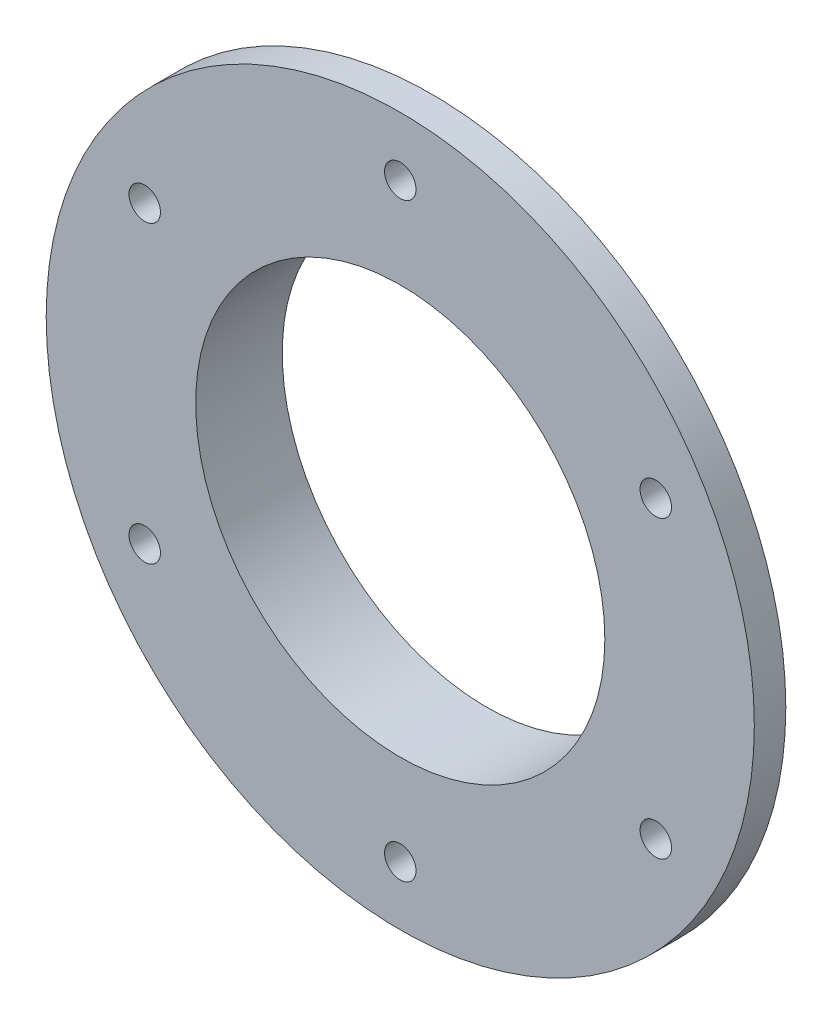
ISO-10303-21;
HEADER;
FILE_DESCRIPTION(('STEP AP214'),'2;1');
FILE_NAME('part.step','',(''),(''),'','','');
FILE_SCHEMA(('AUTOMOTIVE_DESIGN { 1 0 10303 214 1 1 1 1 }'));
ENDSEC;
DATA;
#1=APPLICATION_CONTEXT('core data for automotive mechanical design processes');
#2=APPLICATION_PROTOCOL_DEFINITION('international standard','automotive_design',2000,#1);
#3=PRODUCT_CONTEXT('',#1,'mechanical');
#4=PRODUCT('Part','Part','',(#3));
#5=PRODUCT_RELATED_PRODUCT_CATEGORY('part','',(#4));
#6=PRODUCT_DEFINITION_FORMATION('','',#4);
#7=PRODUCT_DEFINITION_CONTEXT('part definition',#1,'design');
#8=PRODUCT_DEFINITION('design','',#6,#7);
#9=PRODUCT_DEFINITION_SHAPE('','',#8);
#10=(LENGTH_UNIT() NAMED_UNIT(*) SI_UNIT(.MILLI.,.METRE.));
#11=(NAMED_UNIT(*) PLANE_ANGLE_UNIT() SI_UNIT($,.RADIAN.));
#12=(NAMED_UNIT(*) SI_UNIT($,.STERADIAN.) SOLID_ANGLE_UNIT());
#13=UNCERTAINTY_MEASURE_WITH_UNIT(LENGTH_MEASURE(1.E-05),#10,'distance_accuracy_value','');
#14=(GEOMETRIC_REPRESENTATION_CONTEXT(3) GLOBAL_UNCERTAINTY_ASSIGNED_CONTEXT((#13)) GLOBAL_UNIT_ASSIGNED_CONTEXT((#10,
#11,#12)) REPRESENTATION_CONTEXT('',''));
#15=CARTESIAN_POINT('',(0.,0.,0.));
#16=DIRECTION('',(0.,0.,1.));
#17=DIRECTION('',(1.,0.,0.));
#18=AXIS2_PLACEMENT_3D('',#15,#16,#17);
#19=CARTESIAN_POINT('',(0.,0.,0.));
#20=DIRECTION('',(0.,0.,1.));
#21=DIRECTION('',(1.,0.,0.));
#22=AXIS2_PLACEMENT_3D('',#19,#20,#21);
#23=CYLINDRICAL_SURFACE('',#22,52.);
#24=CARTESIAN_POINT('',(0.,0.,-22.));
#25=DIRECTION('',(0.,0.,1.));
#26=DIRECTION('',(1.,0.,0.));
#27=AXIS2_PLACEMENT_3D('',#24,#25,#26);
#28=CIRCLE('',#27,52.);
#29=CARTESIAN_POINT('',(52.,0.,-22.));
#30=VERTEX_POINT('',#29);
#31=EDGE_CURVE('E50',#30,#30,#28,.T.);
#32=ORIENTED_EDGE('',*,*,#31,.F.);
#33=EDGE_LOOP('',(#32));
#34=FACE_BOUND('',#33,.T.);
#35=CARTESIAN_POINT('',(0.,0.,0.));
#36=DIRECTION('',(0.,0.,1.));
#37=DIRECTION('',(1.,0.,0.));
#38=AXIS2_PLACEMENT_3D('',#35,#36,#37);
#39=CIRCLE('',#38,52.);
#40=CARTESIAN_POINT('',(52.,0.,0.));
#41=VERTEX_POINT('',#40);
#42=EDGE_CURVE('E10',#41,#41,#39,.T.);
#43=ORIENTED_EDGE('',*,*,#42,.T.);
#44=EDGE_LOOP('',(#43));
#45=FACE_BOUND('',#44,.T.);
#46=ADVANCED_FACE('F31',(#34,#45),#23,.F.);
#47=CARTESIAN_POINT('',(0.,52.,0.));
#48=DIRECTION('',(0.,0.,-1.));
#49=DIRECTION('',(-1.,0.,0.));
#50=AXIS2_PLACEMENT_3D('',#47,#48,#49);
#51=PLANE('',#50);
#52=CARTESIAN_POINT('',(-64.9519052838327,-37.5000000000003,0.));
#53=DIRECTION('',(0.,0.,1.));
#54=DIRECTION('',(-0.500000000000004,0.866025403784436,0.));
#55=AXIS2_PLACEMENT_3D('',#52,#53,#54);
#56=CIRCLE('',#55,4.);
#57=CARTESIAN_POINT('',(-66.9519052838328,-34.0358983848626,0.));
#58=VERTEX_POINT('',#57);
#59=EDGE_CURVE('E60',#58,#58,#56,.T.);
#60=ORIENTED_EDGE('',*,*,#59,.F.);
#61=EDGE_LOOP('',(#60));
#62=FACE_BOUND('',#61,.T.);
#63=CARTESIAN_POINT('',(0.,-75.,0.));
#64=DIRECTION('',(0.,0.,1.));
#65=DIRECTION('',(-1.,0.,0.));
#66=AXIS2_PLACEMENT_3D('',#63,#64,#65);
#67=CIRCLE('',#66,4.);
#68=CARTESIAN_POINT('',(-4.,-75.,0.));
#69=VERTEX_POINT('',#68);
#70=EDGE_CURVE('E149',#69,#69,#67,.T.);
#71=ORIENTED_EDGE('',*,*,#70,.F.);
#72=EDGE_LOOP('',(#71));
#73=FACE_BOUND('',#72,.T.);
#74=CARTESIAN_POINT('',(64.9519052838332,-37.4999999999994,0.));
#75=DIRECTION('',(0.,0.,1.));
#76=DIRECTION('',(-0.499999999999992,-0.866025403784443,0.));
#77=AXIS2_PLACEMENT_3D('',#74,#75,#76);
#78=CIRCLE('',#77,4.);
#79=CARTESIAN_POINT('',(62.9519052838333,-40.9641016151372,0.));
#80=VERTEX_POINT('',#79);
#81=EDGE_CURVE('E152',#80,#80,#78,.T.);
#82=ORIENTED_EDGE('',*,*,#81,.F.);
#83=EDGE_LOOP('',(#82));
#84=FACE_BOUND('',#83,.T.);
#85=CARTESIAN_POINT('',(64.9519052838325,37.5000000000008,0.));
#86=DIRECTION('',(0.,0.,1.));
#87=DIRECTION('',(0.50000000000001,-0.866025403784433,0.));
#88=AXIS2_PLACEMENT_3D('',#85,#86,#87);
#89=CIRCLE('',#88,4.);
#90=CARTESIAN_POINT('',(66.9519052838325,34.035898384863,0.));
#91=VERTEX_POINT('',#90);
#92=EDGE_CURVE('E75',#91,#91,#89,.T.);
#93=ORIENTED_EDGE('',*,*,#92,.F.);
#94=EDGE_LOOP('',(#93));
#95=FACE_BOUND('',#94,.T.);
#96=CARTESIAN_POINT('',(-64.951905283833,37.4999999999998,0.));
#97=DIRECTION('',(0.,0.,1.));
#98=DIRECTION('',(0.499999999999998,0.86602540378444,0.));
#99=AXIS2_PLACEMENT_3D('',#96,#97,#98);
#100=CIRCLE('',#99,4.);
#101=CARTESIAN_POINT('',(-62.951905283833,40.9641016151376,0.));
#102=VERTEX_POINT('',#101);
#103=EDGE_CURVE('E55',#102,#102,#100,.T.);
#104=ORIENTED_EDGE('',*,*,#103,.F.);
#105=EDGE_LOOP('',(#104));
#106=FACE_BOUND('',#105,.T.);
#107=CARTESIAN_POINT('',(0.,75.,0.));
#108=DIRECTION('',(0.,0.,1.));
#109=DIRECTION('',(1.,0.,0.));
#110=AXIS2_PLACEMENT_3D('',#107,#108,#109);
#111=CIRCLE('',#110,4.);
#112=CARTESIAN_POINT('',(4.,75.,0.));
#113=VERTEX_POINT('',#112);
#114=EDGE_CURVE('E51',#113,#113,#111,.T.);
#115=ORIENTED_EDGE('',*,*,#114,.F.);
#116=EDGE_LOOP('',(#115));
#117=FACE_BOUND('',#116,.T.);
#118=ORIENTED_EDGE('',*,*,#42,.F.);
#119=EDGE_LOOP('',(#118));
#120=FACE_BOUND('',#119,.T.);
#121=CARTESIAN_POINT('',(0.,0.,0.));
#122=DIRECTION('',(0.,0.,1.));
#123=DIRECTION('',(1.,0.,0.));
#124=AXIS2_PLACEMENT_3D('',#121,#122,#123);
#125=CIRCLE('',#124,90.);
#126=CARTESIAN_POINT('',(90.,0.,0.));
#127=VERTEX_POINT('',#126);
#128=EDGE_CURVE('E38',#127,#127,#125,.T.);
#129=ORIENTED_EDGE('',*,*,#128,.T.);
#130=EDGE_LOOP('',(#129));
#131=FACE_BOUND('',#130,.T.);
#132=ADVANCED_FACE('F111',(#62,#73,#84,#95,#106,#117,#120,#131),#51,.F.);
#133=CARTESIAN_POINT('',(0.,0.,0.));
#134=DIRECTION('',(0.,0.,1.));
#135=DIRECTION('',(1.,0.,0.));
#136=AXIS2_PLACEMENT_3D('',#133,#134,#135);
#137=CYLINDRICAL_SURFACE('',#136,90.);
#138=ORIENTED_EDGE('',*,*,#128,.F.);
#139=EDGE_LOOP('',(#138));
#140=FACE_BOUND('',#139,.T.);
#141=CARTESIAN_POINT('',(0.,0.,-8.));
#142=DIRECTION('',(0.,0.,1.));
#143=DIRECTION('',(1.,0.,0.));
#144=AXIS2_PLACEMENT_3D('',#141,#142,#143);
#145=CIRCLE('',#144,90.);
#146=CARTESIAN_POINT('',(90.,0.,-8.));
#147=VERTEX_POINT('',#146);
#148=EDGE_CURVE('E43',#147,#147,#145,.T.);
#149=ORIENTED_EDGE('',*,*,#148,.T.);
#150=EDGE_LOOP('',(#149));
#151=FACE_BOUND('',#150,.T.);
#152=ADVANCED_FACE('F89',(#140,#151),#137,.T.);
#153=CARTESIAN_POINT('',(0.,90.,-8.));
#154=DIRECTION('',(0.,0.,1.));
#155=DIRECTION('',(1.,0.,0.));
#156=AXIS2_PLACEMENT_3D('',#153,#154,#155);
#157=PLANE('',#156);
#158=CARTESIAN_POINT('',(-64.9519052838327,-37.5000000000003,-8.));
#159=DIRECTION('',(0.,0.,1.));
#160=DIRECTION('',(1.,0.,0.));
#161=AXIS2_PLACEMENT_3D('',#158,#159,#160);
#162=CIRCLE('',#161,4.);
#163=CARTESIAN_POINT('',(-60.9519052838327,-37.5000000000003,-8.));
#164=VERTEX_POINT('',#163);
#165=EDGE_CURVE('E34',#164,#164,#162,.T.);
#166=ORIENTED_EDGE('',*,*,#165,.T.);
#167=EDGE_LOOP('',(#166));
#168=FACE_BOUND('',#167,.T.);
#169=CARTESIAN_POINT('',(0.,-75.,-8.));
#170=DIRECTION('',(0.,0.,1.));
#171=DIRECTION('',(1.,0.,0.));
#172=AXIS2_PLACEMENT_3D('',#169,#170,#171);
#173=CIRCLE('',#172,4.);
#174=CARTESIAN_POINT('',(4.,-75.,-8.));
#175=VERTEX_POINT('',#174);
#176=EDGE_CURVE('E62',#175,#175,#173,.T.);
#177=ORIENTED_EDGE('',*,*,#176,.T.);
#178=EDGE_LOOP('',(#177));
#179=FACE_BOUND('',#178,.T.);
#180=CARTESIAN_POINT('',(64.9519052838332,-37.4999999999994,-8.));
#181=DIRECTION('',(0.,0.,1.));
#182=DIRECTION('',(1.,0.,0.));
#183=AXIS2_PLACEMENT_3D('',#180,#181,#182);
#184=CIRCLE('',#183,4.);
#185=CARTESIAN_POINT('',(68.9519052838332,-37.4999999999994,-8.));
#186=VERTEX_POINT('',#185);
#187=EDGE_CURVE('E59',#186,#186,#184,.T.);
#188=ORIENTED_EDGE('',*,*,#187,.T.);
#189=EDGE_LOOP('',(#188));
#190=FACE_BOUND('',#189,.T.);
#191=CARTESIAN_POINT('',(64.9519052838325,37.5000000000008,-8.));
#192=DIRECTION('',(0.,0.,1.));
#193=DIRECTION('',(1.,0.,0.));
#194=AXIS2_PLACEMENT_3D('',#191,#192,#193);
#195=CIRCLE('',#194,4.);
#196=CARTESIAN_POINT('',(68.9519052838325,37.5000000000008,-8.));
#197=VERTEX_POINT('',#196);
#198=EDGE_CURVE('E56',#197,#197,#195,.T.);
#199=ORIENTED_EDGE('',*,*,#198,.T.);
#200=EDGE_LOOP('',(#199));
#201=FACE_BOUND('',#200,.T.);
#202=CARTESIAN_POINT('',(-64.951905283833,37.4999999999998,-8.));
#203=DIRECTION('',(0.,0.,1.));
#204=DIRECTION('',(1.,0.,0.));
#205=AXIS2_PLACEMENT_3D('',#202,#203,#204);
#206=CIRCLE('',#205,4.);
#207=CARTESIAN_POINT('',(-60.951905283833,37.4999999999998,-8.));
#208=VERTEX_POINT('',#207);
#209=EDGE_CURVE('E52',#208,#208,#206,.T.);
#210=ORIENTED_EDGE('',*,*,#209,.T.);
#211=EDGE_LOOP('',(#210));
#212=FACE_BOUND('',#211,.T.);
#213=CARTESIAN_POINT('',(0.,75.,-8.));
#214=DIRECTION('',(0.,0.,1.));
#215=DIRECTION('',(1.,0.,0.));
#216=AXIS2_PLACEMENT_3D('',#213,#214,#215);
#217=CIRCLE('',#216,4.);
#218=CARTESIAN_POINT('',(4.,75.,-8.));
#219=VERTEX_POINT('',#218);
#220=EDGE_CURVE('E47',#219,#219,#217,.T.);
#221=ORIENTED_EDGE('',*,*,#220,.T.);
#222=EDGE_LOOP('',(#221));
#223=FACE_BOUND('',#222,.T.);
#224=ORIENTED_EDGE('',*,*,#148,.F.);
#225=EDGE_LOOP('',(#224));
#226=FACE_BOUND('',#225,.T.);
#227=CARTESIAN_POINT('',(0.,0.,-8.));
#228=DIRECTION('',(0.,0.,1.));
#229=DIRECTION('',(1.,0.,0.));
#230=AXIS2_PLACEMENT_3D('',#227,#228,#229);
#231=CIRCLE('',#230,60.);
#232=CARTESIAN_POINT('',(60.,0.,-8.));
#233=VERTEX_POINT('',#232);
#234=EDGE_CURVE('E84',#233,#233,#231,.T.);
#235=ORIENTED_EDGE('',*,*,#234,.T.);
#236=EDGE_LOOP('',(#235));
#237=FACE_BOUND('',#236,.T.);
#238=ADVANCED_FACE('F91',(#168,#179,#190,#201,#212,#223,#226,#237),#157,.F.);
#239=CARTESIAN_POINT('',(0.,0.,0.));
#240=DIRECTION('',(0.,0.,1.));
#241=DIRECTION('',(1.,0.,0.));
#242=AXIS2_PLACEMENT_3D('',#239,#240,#241);
#243=CYLINDRICAL_SURFACE('',#242,60.);
#244=ORIENTED_EDGE('',*,*,#234,.F.);
#245=EDGE_LOOP('',(#244));
#246=FACE_BOUND('',#245,.T.);
#247=CARTESIAN_POINT('',(0.,0.,-22.));
#248=DIRECTION('',(0.,0.,1.));
#249=DIRECTION('',(1.,0.,0.));
#250=AXIS2_PLACEMENT_3D('',#247,#248,#249);
#251=CIRCLE('',#250,60.);
#252=CARTESIAN_POINT('',(60.,0.,-22.));
#253=VERTEX_POINT('',#252);
#254=EDGE_CURVE('E81',#253,#253,#251,.T.);
#255=ORIENTED_EDGE('',*,*,#254,.T.);
#256=EDGE_LOOP('',(#255));
#257=FACE_BOUND('',#256,.T.);
#258=ADVANCED_FACE('F94',(#246,#257),#243,.T.);
#259=CARTESIAN_POINT('',(0.,60.,-22.));
#260=DIRECTION('',(0.,0.,1.));
#261=DIRECTION('',(1.,0.,0.));
#262=AXIS2_PLACEMENT_3D('',#259,#260,#261);
#263=PLANE('',#262);
#264=ORIENTED_EDGE('',*,*,#254,.F.);
#265=EDGE_LOOP('',(#264));
#266=FACE_BOUND('',#265,.T.);
#267=ORIENTED_EDGE('',*,*,#31,.T.);
#268=EDGE_LOOP('',(#267));
#269=FACE_BOUND('',#268,.T.);
#270=ADVANCED_FACE('F100',(#266,#269),#263,.F.);
#271=CARTESIAN_POINT('',(0.,75.,-22.));
#272=DIRECTION('',(0.,0.,1.));
#273=DIRECTION('',(1.,0.,0.));
#274=AXIS2_PLACEMENT_3D('',#271,#272,#273);
#275=CYLINDRICAL_SURFACE('',#274,4.);
#276=ORIENTED_EDGE('',*,*,#114,.T.);
#277=EDGE_LOOP('',(#276));
#278=FACE_BOUND('',#277,.T.);
#279=ORIENTED_EDGE('',*,*,#220,.F.);
#280=EDGE_LOOP('',(#279));
#281=FACE_BOUND('',#280,.T.);
#282=ADVANCED_FACE('F106',(#278,#281),#275,.F.);
#283=CARTESIAN_POINT('',(-64.951905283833,37.4999999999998,-22.));
#284=DIRECTION('',(0.,0.,1.));
#285=DIRECTION('',(1.,0.,0.));
#286=AXIS2_PLACEMENT_3D('',#283,#284,#285);
#287=CYLINDRICAL_SURFACE('',#286,4.);
#288=ORIENTED_EDGE('',*,*,#103,.T.);
#289=EDGE_LOOP('',(#288));
#290=FACE_BOUND('',#289,.T.);
#291=ORIENTED_EDGE('',*,*,#209,.F.);
#292=EDGE_LOOP('',(#291));
#293=FACE_BOUND('',#292,.T.);
#294=ADVANCED_FACE('F126',(#290,#293),#287,.F.);
#295=CARTESIAN_POINT('',(64.9519052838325,37.5000000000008,-22.));
#296=DIRECTION('',(0.,0.,1.));
#297=DIRECTION('',(1.,0.,0.));
#298=AXIS2_PLACEMENT_3D('',#295,#296,#297);
#299=CYLINDRICAL_SURFACE('',#298,4.);
#300=ORIENTED_EDGE('',*,*,#92,.T.);
#301=EDGE_LOOP('',(#300));
#302=FACE_BOUND('',#301,.T.);
#303=ORIENTED_EDGE('',*,*,#198,.F.);
#304=EDGE_LOOP('',(#303));
#305=FACE_BOUND('',#304,.T.);
#306=ADVANCED_FACE('F130',(#302,#305),#299,.F.);
#307=CARTESIAN_POINT('',(64.9519052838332,-37.4999999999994,-22.));
#308=DIRECTION('',(0.,0.,1.));
#309=DIRECTION('',(1.,0.,0.));
#310=AXIS2_PLACEMENT_3D('',#307,#308,#309);
#311=CYLINDRICAL_SURFACE('',#310,4.);
#312=ORIENTED_EDGE('',*,*,#81,.T.);
#313=EDGE_LOOP('',(#312));
#314=FACE_BOUND('',#313,.T.);
#315=ORIENTED_EDGE('',*,*,#187,.F.);
#316=EDGE_LOOP('',(#315));
#317=FACE_BOUND('',#316,.T.);
#318=ADVANCED_FACE('F133',(#314,#317),#311,.F.);
#319=CARTESIAN_POINT('',(0.,-75.,-22.));
#320=DIRECTION('',(0.,0.,1.));
#321=DIRECTION('',(1.,0.,0.));
#322=AXIS2_PLACEMENT_3D('',#319,#320,#321);
#323=CYLINDRICAL_SURFACE('',#322,4.);
#324=ORIENTED_EDGE('',*,*,#70,.T.);
#325=EDGE_LOOP('',(#324));
#326=FACE_BOUND('',#325,.T.);
#327=ORIENTED_EDGE('',*,*,#176,.F.);
#328=EDGE_LOOP('',(#327));
#329=FACE_BOUND('',#328,.T.);
#330=ADVANCED_FACE('F137',(#326,#329),#323,.F.);
#331=CARTESIAN_POINT('',(-64.9519052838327,-37.5000000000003,-22.));
#332=DIRECTION('',(0.,0.,1.));
#333=DIRECTION('',(1.,0.,0.));
#334=AXIS2_PLACEMENT_3D('',#331,#332,#333);
#335=CYLINDRICAL_SURFACE('',#334,4.);
#336=ORIENTED_EDGE('',*,*,#59,.T.);
#337=EDGE_LOOP('',(#336));
#338=FACE_BOUND('',#337,.T.);
#339=ORIENTED_EDGE('',*,*,#165,.F.);
#340=EDGE_LOOP('',(#339));
#341=FACE_BOUND('',#340,.T.);
#342=ADVANCED_FACE('F141',(#338,#341),#335,.F.);
#343=CLOSED_SHELL('',(#46,#132,#152,#238,#258,#270,#282,#294,#306,#318,#330,#342));
#344=MANIFOLD_SOLID_BREP('B2',#343);
#345=ADVANCED_BREP_SHAPE_REPRESENTATION('',(#18,#344),#14);
#346=SHAPE_DEFINITION_REPRESENTATION(#9,#345);
ENDSEC;
END-ISO-10303-21;
